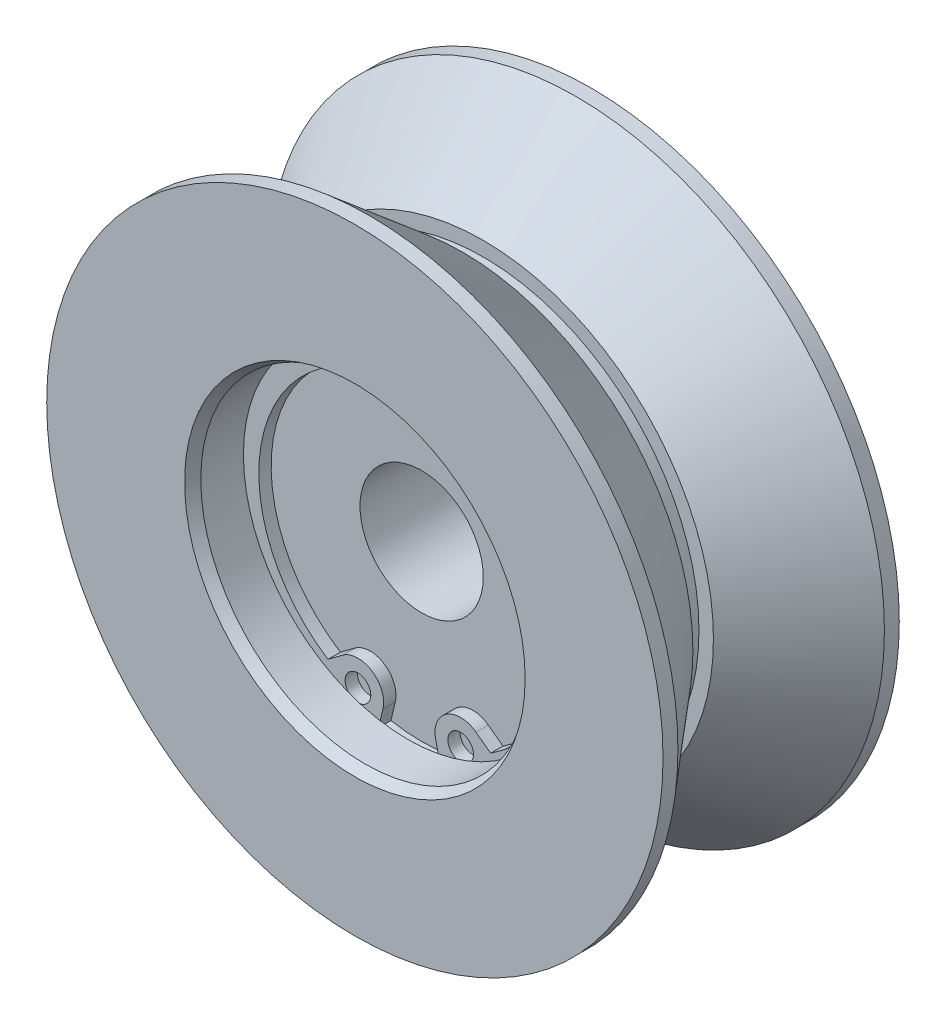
ISO-10303-21;
HEADER;
FILE_DESCRIPTION(('STEP AP214'),'2;1');
FILE_NAME('part.step','',(''),(''),'','','');
FILE_SCHEMA(('AUTOMOTIVE_DESIGN { 1 0 10303 214 1 1 1 1 }'));
ENDSEC;
DATA;
#1=APPLICATION_CONTEXT('core data for automotive mechanical design processes');
#2=APPLICATION_PROTOCOL_DEFINITION('international standard','automotive_design',2000,#1);
#3=PRODUCT_CONTEXT('',#1,'mechanical');
#4=PRODUCT('Part','Part','',(#3));
#5=PRODUCT_RELATED_PRODUCT_CATEGORY('part','',(#4));
#6=PRODUCT_DEFINITION_FORMATION('','',#4);
#7=PRODUCT_DEFINITION_CONTEXT('part definition',#1,'design');
#8=PRODUCT_DEFINITION('design','',#6,#7);
#9=PRODUCT_DEFINITION_SHAPE('','',#8);
#10=(LENGTH_UNIT() NAMED_UNIT(*) SI_UNIT(.MILLI.,.METRE.));
#11=(NAMED_UNIT(*) PLANE_ANGLE_UNIT() SI_UNIT($,.RADIAN.));
#12=(NAMED_UNIT(*) SI_UNIT($,.STERADIAN.) SOLID_ANGLE_UNIT());
#13=UNCERTAINTY_MEASURE_WITH_UNIT(LENGTH_MEASURE(1.E-05),#10,'distance_accuracy_value','');
#14=(GEOMETRIC_REPRESENTATION_CONTEXT(3) GLOBAL_UNCERTAINTY_ASSIGNED_CONTEXT((#13)) GLOBAL_UNIT_ASSIGNED_CONTEXT((#10,
#11,#12)) REPRESENTATION_CONTEXT('',''));
#15=CARTESIAN_POINT('',(0.,0.,0.));
#16=DIRECTION('',(0.,0.,1.));
#17=DIRECTION('',(1.,0.,0.));
#18=AXIS2_PLACEMENT_3D('',#15,#16,#17);
#19=CARTESIAN_POINT('',(0.,-0.95,6.2));
#20=DIRECTION('',(0.,0.,1.));
#21=DIRECTION('',(-1.,0.,0.));
#22=AXIS2_PLACEMENT_3D('',#19,#20,#21);
#23=CYLINDRICAL_SURFACE('',#22,14.65);
#24=CARTESIAN_POINT('',(0.,-0.95,5.));
#25=DIRECTION('',(0.,0.,-1.));
#26=DIRECTION('',(0.,-1.,0.));
#27=AXIS2_PLACEMENT_3D('',#24,#25,#26);
#28=CIRCLE('',#27,14.65);
#29=CARTESIAN_POINT('',(-7.91695293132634,-13.2765711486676,5.));
#30=VERTEX_POINT('',#29);
#31=CARTESIAN_POINT('',(7.91695293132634,-13.2765711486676,5.));
#32=VERTEX_POINT('',#31);
#33=EDGE_CURVE('E161',#30,#32,#28,.T.);
#34=ORIENTED_EDGE('',*,*,#33,.T.);
#35=DIRECTION('',(0.,0.,-1.));
#36=VECTOR('',#35,1.);
#37=CARTESIAN_POINT('',(7.91695293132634,-13.2765711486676,6.2));
#38=LINE('',#37,#36);
#39=CARTESIAN_POINT('',(7.91695293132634,-13.2765711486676,6.2));
#40=VERTEX_POINT('',#39);
#41=EDGE_CURVE('E101',#40,#32,#38,.T.);
#42=ORIENTED_EDGE('',*,*,#41,.F.);
#43=CARTESIAN_POINT('',(0.,-0.95,6.2));
#44=DIRECTION('',(0.,0.,-1.));
#45=DIRECTION('',(0.,-1.,0.));
#46=AXIS2_PLACEMENT_3D('',#43,#44,#45);
#47=CIRCLE('',#46,14.65);
#48=CARTESIAN_POINT('',(-7.91695293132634,-13.2765711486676,6.2));
#49=VERTEX_POINT('',#48);
#50=EDGE_CURVE('E102',#49,#40,#47,.T.);
#51=ORIENTED_EDGE('',*,*,#50,.F.);
#52=DIRECTION('',(0.,0.,-1.));
#53=VECTOR('',#52,1.);
#54=CARTESIAN_POINT('',(-7.91695293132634,-13.2765711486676,6.2));
#55=LINE('',#54,#53);
#56=EDGE_CURVE('E96',#49,#30,#55,.T.);
#57=ORIENTED_EDGE('',*,*,#56,.T.);
#58=EDGE_LOOP('',(#34,#42,#51,#57));
#59=FACE_BOUND('',#58,.T.);
#60=ADVANCED_FACE('F14',(#59),#23,.F.);
#61=CARTESIAN_POINT('',(6.49138441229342,-12.2169439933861,6.2));
#62=DIRECTION('',(-0.596553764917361,-0.802573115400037,0.));
#63=DIRECTION('',(-0.802573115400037,0.596553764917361,0.));
#64=AXIS2_PLACEMENT_3D('',#61,#62,#63);
#65=PLANE('',#64);
#66=DIRECTION('',(-0.802573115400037,0.596553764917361,0.));
#67=VECTOR('',#66,1.);
#68=CARTESIAN_POINT('',(6.49138441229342,-12.2169439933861,5.));
#69=LINE('',#68,#67);
#70=CARTESIAN_POINT('',(6.49138441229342,-12.2169439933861,5.));
#71=VERTEX_POINT('',#70);
#72=EDGE_CURVE('E145',#32,#71,#69,.T.);
#73=ORIENTED_EDGE('',*,*,#72,.T.);
#74=DIRECTION('',(0.,0.,-1.));
#75=VECTOR('',#74,1.);
#76=CARTESIAN_POINT('',(6.49138441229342,-12.2169439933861,6.2));
#77=LINE('',#76,#75);
#78=CARTESIAN_POINT('',(6.49138441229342,-12.2169439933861,6.2));
#79=VERTEX_POINT('',#78);
#80=EDGE_CURVE('E150',#79,#71,#77,.T.);
#81=ORIENTED_EDGE('',*,*,#80,.F.);
#82=DIRECTION('',(-0.802573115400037,0.596553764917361,0.));
#83=VECTOR('',#82,1.);
#84=CARTESIAN_POINT('',(6.49138441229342,-12.2169439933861,6.2));
#85=LINE('',#84,#83);
#86=EDGE_CURVE('E135',#40,#79,#85,.T.);
#87=ORIENTED_EDGE('',*,*,#86,.F.);
#88=ORIENTED_EDGE('',*,*,#41,.T.);
#89=EDGE_LOOP('',(#73,#81,#87,#88));
#90=FACE_BOUND('',#89,.T.);
#91=ADVANCED_FACE('F291',(#90),#65,.F.);
#92=CARTESIAN_POINT('',(5.,-14.2233767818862,6.2));
#93=DIRECTION('',(0.,0.,1.));
#94=DIRECTION('',(-1.,0.,0.));
#95=AXIS2_PLACEMENT_3D('',#92,#93,#94);
#96=CYLINDRICAL_SURFACE('',#95,2.5);
#97=CARTESIAN_POINT('',(5.,-14.2233767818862,5.));
#98=DIRECTION('',(0.,0.,1.));
#99=DIRECTION('',(1.,0.,0.));
#100=AXIS2_PLACEMENT_3D('',#97,#98,#99);
#101=CIRCLE('',#100,2.5);
#102=CARTESIAN_POINT('',(2.5678231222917,-14.8017500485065,5.));
#103=VERTEX_POINT('',#102);
#104=EDGE_CURVE('E131',#71,#103,#101,.T.);
#105=ORIENTED_EDGE('',*,*,#104,.T.);
#106=DIRECTION('',(0.,0.,-1.));
#107=VECTOR('',#106,1.);
#108=CARTESIAN_POINT('',(2.5678231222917,-14.8017500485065,6.2));
#109=LINE('',#108,#107);
#110=CARTESIAN_POINT('',(2.5678231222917,-14.8017500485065,6.2));
#111=VERTEX_POINT('',#110);
#112=EDGE_CURVE('E151',#111,#103,#109,.T.);
#113=ORIENTED_EDGE('',*,*,#112,.F.);
#114=CARTESIAN_POINT('',(5.,-14.2233767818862,6.2));
#115=DIRECTION('',(0.,0.,1.));
#116=DIRECTION('',(1.,0.,0.));
#117=AXIS2_PLACEMENT_3D('',#114,#115,#116);
#118=CIRCLE('',#117,2.5);
#119=EDGE_CURVE('E166',#79,#111,#118,.T.);
#120=ORIENTED_EDGE('',*,*,#119,.F.);
#121=ORIENTED_EDGE('',*,*,#80,.T.);
#122=EDGE_LOOP('',(#105,#113,#120,#121));
#123=FACE_BOUND('',#122,.T.);
#124=ADVANCED_FACE('F288',(#123),#96,.T.);
#125=CARTESIAN_POINT('',(-2.56782312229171,-14.8017500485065,6.2));
#126=DIRECTION('',(-0.97287075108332,0.231349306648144,0.));
#127=DIRECTION('',(0.,0.,1.));
#128=AXIS2_PLACEMENT_3D('',#125,#126,#127);
#129=PLANE('',#128);
#130=DIRECTION('',(0.,0.,1.));
#131=VECTOR('',#130,1.);
#132=CARTESIAN_POINT('',(-2.99125499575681,-16.5823669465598,20.1183293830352));
#133=LINE('',#132,#131);
#134=CARTESIAN_POINT('',(-2.99125499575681,-16.5823669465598,5.));
#135=VERTEX_POINT('',#134);
#136=CARTESIAN_POINT('',(-2.99125499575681,-16.5823669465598,6.2));
#137=VERTEX_POINT('',#136);
#138=EDGE_CURVE('E175',#135,#137,#133,.T.);
#139=ORIENTED_EDGE('',*,*,#138,.F.);
#140=DIRECTION('',(0.231349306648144,0.97287075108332,0.));
#141=VECTOR('',#140,1.);
#142=CARTESIAN_POINT('',(-2.56782312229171,-14.8017500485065,5.));
#143=LINE('',#142,#141);
#144=CARTESIAN_POINT('',(-2.56782312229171,-14.8017500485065,5.));
#145=VERTEX_POINT('',#144);
#146=EDGE_CURVE('E152',#135,#145,#143,.T.);
#147=ORIENTED_EDGE('',*,*,#146,.T.);
#148=DIRECTION('',(0.,0.,-1.));
#149=VECTOR('',#148,1.);
#150=CARTESIAN_POINT('',(-2.56782312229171,-14.8017500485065,6.2));
#151=LINE('',#150,#149);
#152=CARTESIAN_POINT('',(-2.56782312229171,-14.8017500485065,6.2));
#153=VERTEX_POINT('',#152);
#154=EDGE_CURVE('E171',#153,#145,#151,.T.);
#155=ORIENTED_EDGE('',*,*,#154,.F.);
#156=DIRECTION('',(0.231349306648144,0.97287075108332,0.));
#157=VECTOR('',#156,1.);
#158=CARTESIAN_POINT('',(-2.56782312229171,-14.8017500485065,6.2));
#159=LINE('',#158,#157);
#160=EDGE_CURVE('E119',#137,#153,#159,.T.);
#161=ORIENTED_EDGE('',*,*,#160,.F.);
#162=EDGE_LOOP('',(#139,#147,#155,#161));
#163=FACE_BOUND('',#162,.T.);
#164=ADVANCED_FACE('F301',(#163),#129,.F.);
#165=CARTESIAN_POINT('',(0.,-0.95,6.2));
#166=DIRECTION('',(0.,0.,-1.));
#167=DIRECTION('',(0.,-1.,0.));
#168=AXIS2_PLACEMENT_3D('',#165,#166,#167);
#169=PLANE('',#168);
#170=CARTESIAN_POINT('',(5.,-14.2233767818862,6.2));
#171=DIRECTION('',(0.,0.,1.));
#172=DIRECTION('',(1.,0.,0.));
#173=AXIS2_PLACEMENT_3D('',#170,#171,#172);
#174=CIRCLE('',#173,1.25);
#175=CARTESIAN_POINT('',(6.25,-14.2233767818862,6.2));
#176=VERTEX_POINT('',#175);
#177=EDGE_CURVE('E137',#176,#176,#174,.T.);
#178=ORIENTED_EDGE('',*,*,#177,.F.);
#179=EDGE_LOOP('',(#178));
#180=FACE_BOUND('',#179,.T.);
#181=CARTESIAN_POINT('',(-5.,-14.2233767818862,6.2));
#182=DIRECTION('',(0.,0.,-1.));
#183=DIRECTION('',(1.,0.,0.));
#184=AXIS2_PLACEMENT_3D('',#181,#182,#183);
#185=CIRCLE('',#184,1.25);
#186=CARTESIAN_POINT('',(-3.75,-14.2233767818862,6.2));
#187=VERTEX_POINT('',#186);
#188=EDGE_CURVE('E121',#187,#187,#185,.T.);
#189=ORIENTED_EDGE('',*,*,#188,.T.);
#190=EDGE_LOOP('',(#189));
#191=FACE_BOUND('',#190,.T.);
#192=CARTESIAN_POINT('',(0.,0.,6.2));
#193=DIRECTION('',(0.,0.,-1.));
#194=DIRECTION('',(-1.,0.,0.));
#195=AXIS2_PLACEMENT_3D('',#192,#193,#194);
#196=CIRCLE('',#195,16.85);
#197=CARTESIAN_POINT('',(2.99125499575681,-16.5823669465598,6.2));
#198=VERTEX_POINT('',#197);
#199=EDGE_CURVE('E9',#137,#198,#196,.T.);
#200=ORIENTED_EDGE('',*,*,#199,.F.);
#201=ORIENTED_EDGE('',*,*,#160,.T.);
#202=CARTESIAN_POINT('',(-5.,-14.2233767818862,6.2));
#203=DIRECTION('',(0.,0.,1.));
#204=DIRECTION('',(-1.,0.,0.));
#205=AXIS2_PLACEMENT_3D('',#202,#203,#204);
#206=CIRCLE('',#205,2.5);
#207=CARTESIAN_POINT('',(-6.49138441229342,-12.2169439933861,6.2));
#208=VERTEX_POINT('',#207);
#209=EDGE_CURVE('E108',#153,#208,#206,.T.);
#210=ORIENTED_EDGE('',*,*,#209,.T.);
#211=DIRECTION('',(-0.802573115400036,-0.596553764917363,0.));
#212=VECTOR('',#211,1.);
#213=CARTESIAN_POINT('',(-6.49138441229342,-12.2169439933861,6.2));
#214=LINE('',#213,#212);
#215=EDGE_CURVE('E91',#208,#49,#214,.T.);
#216=ORIENTED_EDGE('',*,*,#215,.T.);
#217=ORIENTED_EDGE('',*,*,#50,.T.);
#218=ORIENTED_EDGE('',*,*,#86,.T.);
#219=ORIENTED_EDGE('',*,*,#119,.T.);
#220=DIRECTION('',(0.231349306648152,-0.972870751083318,0.));
#221=VECTOR('',#220,1.);
#222=CARTESIAN_POINT('',(2.5678231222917,-14.8017500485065,6.2));
#223=LINE('',#222,#221);
#224=EDGE_CURVE('E127',#111,#198,#223,.T.);
#225=ORIENTED_EDGE('',*,*,#224,.T.);
#226=EDGE_LOOP('',(#200,#201,#210,#216,#217,#218,#219,#225));
#227=FACE_BOUND('',#226,.T.);
#228=ADVANCED_FACE('F117',(#180,#191,#227),#169,.F.);
#229=CARTESIAN_POINT('',(5.,-14.2233767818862,6.2));
#230=DIRECTION('',(0.,0.,1.));
#231=DIRECTION('',(-1.,0.,0.));
#232=AXIS2_PLACEMENT_3D('',#229,#230,#231);
#233=CYLINDRICAL_SURFACE('',#232,1.25);
#234=CARTESIAN_POINT('',(5.,-14.2233767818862,5.));
#235=DIRECTION('',(0.,0.,1.));
#236=DIRECTION('',(1.,0.,0.));
#237=AXIS2_PLACEMENT_3D('',#234,#235,#236);
#238=CIRCLE('',#237,1.25);
#239=CARTESIAN_POINT('',(6.25,-14.2233767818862,5.));
#240=VERTEX_POINT('',#239);
#241=EDGE_CURVE('E114',#240,#240,#238,.T.);
#242=ORIENTED_EDGE('',*,*,#241,.F.);
#243=EDGE_LOOP('',(#242));
#244=FACE_BOUND('',#243,.T.);
#245=ORIENTED_EDGE('',*,*,#177,.T.);
#246=EDGE_LOOP('',(#245));
#247=FACE_BOUND('',#246,.T.);
#248=ADVANCED_FACE('F309',(#244,#247),#233,.F.);
#249=CARTESIAN_POINT('',(-5.,-14.2233767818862,6.2));
#250=DIRECTION('',(0.,0.,1.));
#251=DIRECTION('',(-1.,0.,0.));
#252=AXIS2_PLACEMENT_3D('',#249,#250,#251);
#253=CYLINDRICAL_SURFACE('',#252,1.25);
#254=CARTESIAN_POINT('',(-5.,-14.2233767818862,5.));
#255=DIRECTION('',(0.,0.,-1.));
#256=DIRECTION('',(1.,0.,0.));
#257=AXIS2_PLACEMENT_3D('',#254,#255,#256);
#258=CIRCLE('',#257,1.25);
#259=CARTESIAN_POINT('',(-3.75,-14.2233767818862,5.));
#260=VERTEX_POINT('',#259);
#261=EDGE_CURVE('E140',#260,#260,#258,.T.);
#262=ORIENTED_EDGE('',*,*,#261,.T.);
#263=EDGE_LOOP('',(#262));
#264=FACE_BOUND('',#263,.T.);
#265=ORIENTED_EDGE('',*,*,#188,.F.);
#266=EDGE_LOOP('',(#265));
#267=FACE_BOUND('',#266,.T.);
#268=ADVANCED_FACE('F557',(#264,#267),#253,.F.);
#269=CARTESIAN_POINT('',(-6.49138441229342,-12.2169439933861,6.2));
#270=DIRECTION('',(0.596553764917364,-0.802573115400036,0.));
#271=DIRECTION('',(0.,0.,-1.));
#272=AXIS2_PLACEMENT_3D('',#269,#270,#271);
#273=PLANE('',#272);
#274=DIRECTION('',(-0.802573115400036,-0.596553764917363,0.));
#275=VECTOR('',#274,1.);
#276=CARTESIAN_POINT('',(-6.49138441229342,-12.2169439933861,5.));
#277=LINE('',#276,#275);
#278=CARTESIAN_POINT('',(-6.49138441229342,-12.2169439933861,5.));
#279=VERTEX_POINT('',#278);
#280=EDGE_CURVE('E113',#279,#30,#277,.T.);
#281=ORIENTED_EDGE('',*,*,#280,.T.);
#282=ORIENTED_EDGE('',*,*,#56,.F.);
#283=ORIENTED_EDGE('',*,*,#215,.F.);
#284=DIRECTION('',(0.,0.,-1.));
#285=VECTOR('',#284,1.);
#286=CARTESIAN_POINT('',(-6.49138441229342,-12.2169439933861,6.2));
#287=LINE('',#286,#285);
#288=EDGE_CURVE('E94',#208,#279,#287,.T.);
#289=ORIENTED_EDGE('',*,*,#288,.T.);
#290=EDGE_LOOP('',(#281,#282,#283,#289));
#291=FACE_BOUND('',#290,.T.);
#292=ADVANCED_FACE('F93',(#291),#273,.F.);
#293=CARTESIAN_POINT('',(-5.,-14.2233767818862,6.2));
#294=DIRECTION('',(0.,0.,1.));
#295=DIRECTION('',(-1.,0.,0.));
#296=AXIS2_PLACEMENT_3D('',#293,#294,#295);
#297=CYLINDRICAL_SURFACE('',#296,2.5);
#298=CARTESIAN_POINT('',(-5.,-14.2233767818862,5.));
#299=DIRECTION('',(0.,0.,1.));
#300=DIRECTION('',(-1.,0.,0.));
#301=AXIS2_PLACEMENT_3D('',#298,#299,#300);
#302=CIRCLE('',#301,2.5);
#303=EDGE_CURVE('E110',#145,#279,#302,.T.);
#304=ORIENTED_EDGE('',*,*,#303,.T.);
#305=ORIENTED_EDGE('',*,*,#288,.F.);
#306=ORIENTED_EDGE('',*,*,#209,.F.);
#307=ORIENTED_EDGE('',*,*,#154,.T.);
#308=EDGE_LOOP('',(#304,#305,#306,#307));
#309=FACE_BOUND('',#308,.T.);
#310=ADVANCED_FACE('F106',(#309),#297,.T.);
#311=CARTESIAN_POINT('',(2.5678231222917,-14.8017500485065,6.2));
#312=DIRECTION('',(0.972870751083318,0.231349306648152,0.));
#313=DIRECTION('',(0.,0.,-1.));
#314=AXIS2_PLACEMENT_3D('',#311,#312,#313);
#315=PLANE('',#314);
#316=DIRECTION('',(0.,0.,1.));
#317=VECTOR('',#316,1.);
#318=CARTESIAN_POINT('',(2.99125499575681,-16.5823669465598,20.1183293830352));
#319=LINE('',#318,#317);
#320=CARTESIAN_POINT('',(2.99125499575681,-16.5823669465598,5.));
#321=VERTEX_POINT('',#320);
#322=EDGE_CURVE('E18',#198,#321,#319,.F.);
#323=ORIENTED_EDGE('',*,*,#322,.F.);
#324=ORIENTED_EDGE('',*,*,#224,.F.);
#325=ORIENTED_EDGE('',*,*,#112,.T.);
#326=DIRECTION('',(0.231349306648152,-0.972870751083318,0.));
#327=VECTOR('',#326,1.);
#328=CARTESIAN_POINT('',(2.5678231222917,-14.8017500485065,5.));
#329=LINE('',#328,#327);
#330=EDGE_CURVE('E32',#103,#321,#329,.T.);
#331=ORIENTED_EDGE('',*,*,#330,.T.);
#332=EDGE_LOOP('',(#323,#324,#325,#331));
#333=FACE_BOUND('',#332,.T.);
#334=ADVANCED_FACE('F270',(#333),#315,.F.);
#335=CARTESIAN_POINT('',(0.,6.,5.));
#336=DIRECTION('',(0.,0.,-1.));
#337=DIRECTION('',(-1.,0.,0.));
#338=AXIS2_PLACEMENT_3D('',#335,#336,#337);
#339=PLANE('',#338);
#340=ORIENTED_EDGE('',*,*,#241,.T.);
#341=EDGE_LOOP('',(#340));
#342=FACE_BOUND('',#341,.T.);
#343=ADVANCED_FACE('F262',(#342),#339,.F.);
#344=ORIENTED_EDGE('',*,*,#261,.F.);
#345=EDGE_LOOP('',(#344));
#346=FACE_BOUND('',#345,.T.);
#347=ADVANCED_FACE('F261',(#346),#339,.F.);
#348=CARTESIAN_POINT('',(0.,0.,20.1183293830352));
#349=DIRECTION('',(0.,0.,1.));
#350=DIRECTION('',(1.,0.,0.));
#351=AXIS2_PLACEMENT_3D('',#348,#349,#350);
#352=CYLINDRICAL_SURFACE('',#351,21.);
#353=CARTESIAN_POINT('',(0.,0.,1.));
#354=DIRECTION('',(0.,0.,1.));
#355=DIRECTION('',(1.,0.,0.));
#356=AXIS2_PLACEMENT_3D('',#353,#354,#355);
#357=CIRCLE('',#356,21.);
#358=CARTESIAN_POINT('',(21.,0.,1.));
#359=VERTEX_POINT('',#358);
#360=EDGE_CURVE('E186',#359,#359,#357,.T.);
#361=ORIENTED_EDGE('',*,*,#360,.F.);
#362=EDGE_LOOP('',(#361));
#363=FACE_BOUND('',#362,.T.);
#364=CARTESIAN_POINT('',(0.,0.,-1.));
#365=DIRECTION('',(0.,0.,1.));
#366=DIRECTION('',(1.,0.,0.));
#367=AXIS2_PLACEMENT_3D('',#364,#365,#366);
#368=CIRCLE('',#367,21.);
#369=CARTESIAN_POINT('',(21.,0.,-1.));
#370=VERTEX_POINT('',#369);
#371=EDGE_CURVE('E183',#370,#370,#368,.T.);
#372=ORIENTED_EDGE('',*,*,#371,.T.);
#373=EDGE_LOOP('',(#372));
#374=FACE_BOUND('',#373,.T.);
#375=ADVANCED_FACE('F320',(#363,#374),#352,.T.);
#376=CARTESIAN_POINT('',(0.,21.,1.));
#377=DIRECTION('',(0.,0.,1.));
#378=DIRECTION('',(1.,0.,0.));
#379=AXIS2_PLACEMENT_3D('',#376,#377,#378);
#380=PLANE('',#379);
#381=CARTESIAN_POINT('',(0.,0.,1.));
#382=DIRECTION('',(0.,0.,1.));
#383=DIRECTION('',(1.,0.,0.));
#384=AXIS2_PLACEMENT_3D('',#381,#382,#383);
#385=CIRCLE('',#384,22.4061483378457);
#386=CARTESIAN_POINT('',(22.4061483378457,0.,1.));
#387=VERTEX_POINT('',#386);
#388=EDGE_CURVE('E189',#387,#387,#385,.T.);
#389=ORIENTED_EDGE('',*,*,#388,.F.);
#390=EDGE_LOOP('',(#389));
#391=FACE_BOUND('',#390,.T.);
#392=ORIENTED_EDGE('',*,*,#360,.T.);
#393=EDGE_LOOP('',(#392));
#394=FACE_BOUND('',#393,.T.);
#395=ADVANCED_FACE('F341',(#391,#394),#380,.F.);
#396=CARTESIAN_POINT('',(0.,21.,-1.));
#397=DIRECTION('',(0.,0.,-1.));
#398=DIRECTION('',(-1.,0.,0.));
#399=AXIS2_PLACEMENT_3D('',#396,#397,#398);
#400=PLANE('',#399);
#401=ORIENTED_EDGE('',*,*,#371,.F.);
#402=EDGE_LOOP('',(#401));
#403=FACE_BOUND('',#402,.T.);
#404=CARTESIAN_POINT('',(0.,0.,-1.));
#405=DIRECTION('',(0.,0.,1.));
#406=DIRECTION('',(1.,0.,0.));
#407=AXIS2_PLACEMENT_3D('',#404,#405,#406);
#408=CIRCLE('',#407,22.4061483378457);
#409=CARTESIAN_POINT('',(22.4061483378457,0.,-1.));
#410=VERTEX_POINT('',#409);
#411=EDGE_CURVE('E180',#410,#410,#408,.T.);
#412=ORIENTED_EDGE('',*,*,#411,.T.);
#413=EDGE_LOOP('',(#412));
#414=FACE_BOUND('',#413,.T.);
#415=ADVANCED_FACE('F338',(#403,#414),#400,.F.);
#416=CARTESIAN_POINT('',(0.,0.,1.));
#417=DIRECTION('',(0.,0.,1.));
#418=DIRECTION('',(1.,0.,0.));
#419=AXIS2_PLACEMENT_3D('',#416,#417,#418);
#420=CONICAL_SURFACE('',#419,22.4061483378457,0.69813170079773);
#421=CARTESIAN_POINT('',(0.,0.,10.05));
#422=DIRECTION('',(0.,0.,1.));
#423=DIRECTION('',(1.,0.,0.));
#424=AXIS2_PLACEMENT_3D('',#421,#422,#423);
#425=CIRCLE('',#424,30.);
#426=CARTESIAN_POINT('',(30.,0.,10.05));
#427=VERTEX_POINT('',#426);
#428=EDGE_CURVE('E192',#427,#427,#425,.T.);
#429=ORIENTED_EDGE('',*,*,#428,.F.);
#430=EDGE_LOOP('',(#429));
#431=FACE_BOUND('',#430,.T.);
#432=ORIENTED_EDGE('',*,*,#388,.T.);
#433=EDGE_LOOP('',(#432));
#434=FACE_BOUND('',#433,.T.);
#435=ADVANCED_FACE('F336',(#431,#434),#420,.T.);
#436=CARTESIAN_POINT('',(0.,0.,-10.05));
#437=DIRECTION('',(0.,0.,-1.));
#438=DIRECTION('',(-1.,0.,0.));
#439=AXIS2_PLACEMENT_3D('',#436,#437,#438);
#440=CONICAL_SURFACE('',#439,30.,0.69813170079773);
#441=ORIENTED_EDGE('',*,*,#411,.F.);
#442=EDGE_LOOP('',(#441));
#443=FACE_BOUND('',#442,.T.);
#444=CARTESIAN_POINT('',(0.,0.,-10.05));
#445=DIRECTION('',(0.,0.,1.));
#446=DIRECTION('',(1.,0.,0.));
#447=AXIS2_PLACEMENT_3D('',#444,#445,#446);
#448=CIRCLE('',#447,30.);
#449=CARTESIAN_POINT('',(30.,0.,-10.05));
#450=VERTEX_POINT('',#449);
#451=EDGE_CURVE('E177',#450,#450,#448,.T.);
#452=ORIENTED_EDGE('',*,*,#451,.T.);
#453=EDGE_LOOP('',(#452));
#454=FACE_BOUND('',#453,.T.);
#455=ADVANCED_FACE('F332',(#443,#454),#440,.T.);
#456=CARTESIAN_POINT('',(0.,0.,20.1183293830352));
#457=DIRECTION('',(0.,0.,1.));
#458=DIRECTION('',(1.,0.,0.));
#459=AXIS2_PLACEMENT_3D('',#456,#457,#458);
#460=CYLINDRICAL_SURFACE('',#459,30.);
#461=CARTESIAN_POINT('',(0.,0.,11.5));
#462=DIRECTION('',(0.,0.,1.));
#463=DIRECTION('',(1.,0.,0.));
#464=AXIS2_PLACEMENT_3D('',#461,#462,#463);
#465=CIRCLE('',#464,30.);
#466=CARTESIAN_POINT('',(30.,0.,11.5));
#467=VERTEX_POINT('',#466);
#468=EDGE_CURVE('E195',#467,#467,#465,.T.);
#469=ORIENTED_EDGE('',*,*,#468,.F.);
#470=EDGE_LOOP('',(#469));
#471=FACE_BOUND('',#470,.T.);
#472=ORIENTED_EDGE('',*,*,#428,.T.);
#473=EDGE_LOOP('',(#472));
#474=FACE_BOUND('',#473,.T.);
#475=ADVANCED_FACE('F335',(#471,#474),#460,.T.);
#476=CARTESIAN_POINT('',(0.,0.,20.1183293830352));
#477=DIRECTION('',(0.,0.,1.));
#478=DIRECTION('',(1.,0.,0.));
#479=AXIS2_PLACEMENT_3D('',#476,#477,#478);
#480=CYLINDRICAL_SURFACE('',#479,30.);
#481=ORIENTED_EDGE('',*,*,#451,.F.);
#482=EDGE_LOOP('',(#481));
#483=FACE_BOUND('',#482,.T.);
#484=CARTESIAN_POINT('',(0.,0.,-11.5));
#485=DIRECTION('',(0.,0.,1.));
#486=DIRECTION('',(1.,0.,0.));
#487=AXIS2_PLACEMENT_3D('',#484,#485,#486);
#488=CIRCLE('',#487,30.);
#489=CARTESIAN_POINT('',(30.,0.,-11.5));
#490=VERTEX_POINT('',#489);
#491=EDGE_CURVE('E141',#490,#490,#488,.T.);
#492=ORIENTED_EDGE('',*,*,#491,.T.);
#493=EDGE_LOOP('',(#492));
#494=FACE_BOUND('',#493,.T.);
#495=ADVANCED_FACE('F16',(#483,#494),#480,.T.);
#496=CARTESIAN_POINT('',(0.,30.,11.5));
#497=DIRECTION('',(0.,0.,-1.));
#498=DIRECTION('',(-1.,0.,0.));
#499=AXIS2_PLACEMENT_3D('',#496,#497,#498);
#500=PLANE('',#499);
#501=CARTESIAN_POINT('',(0.,0.,11.5));
#502=DIRECTION('',(0.,0.,1.));
#503=DIRECTION('',(1.,0.,0.));
#504=AXIS2_PLACEMENT_3D('',#501,#502,#503);
#505=CIRCLE('',#504,16.5773502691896);
#506=CARTESIAN_POINT('',(16.5773502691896,0.,11.5));
#507=VERTEX_POINT('',#506);
#508=EDGE_CURVE('E198',#507,#507,#505,.T.);
#509=ORIENTED_EDGE('',*,*,#508,.F.);
#510=EDGE_LOOP('',(#509));
#511=FACE_BOUND('',#510,.T.);
#512=ORIENTED_EDGE('',*,*,#468,.T.);
#513=EDGE_LOOP('',(#512));
#514=FACE_BOUND('',#513,.T.);
#515=ADVANCED_FACE('F233',(#511,#514),#500,.F.);
#516=CARTESIAN_POINT('',(0.,13.,-11.5));
#517=DIRECTION('',(0.,0.,1.));
#518=DIRECTION('',(1.,0.,0.));
#519=AXIS2_PLACEMENT_3D('',#516,#517,#518);
#520=PLANE('',#519);
#521=ORIENTED_EDGE('',*,*,#491,.F.);
#522=EDGE_LOOP('',(#521));
#523=FACE_BOUND('',#522,.T.);
#524=CARTESIAN_POINT('',(0.,0.,-11.5));
#525=DIRECTION('',(0.,0.,1.));
#526=DIRECTION('',(1.,0.,0.));
#527=AXIS2_PLACEMENT_3D('',#524,#525,#526);
#528=CIRCLE('',#527,13.);
#529=CARTESIAN_POINT('',(13.,0.,-11.5));
#530=VERTEX_POINT('',#529);
#531=EDGE_CURVE('E222',#530,#530,#528,.T.);
#532=ORIENTED_EDGE('',*,*,#531,.T.);
#533=EDGE_LOOP('',(#532));
#534=FACE_BOUND('',#533,.T.);
#535=ADVANCED_FACE('F229',(#523,#534),#520,.F.);
#536=CARTESIAN_POINT('',(0.,0.,11.5));
#537=DIRECTION('',(0.,0.,1.));
#538=DIRECTION('',(1.,0.,0.));
#539=AXIS2_PLACEMENT_3D('',#536,#537,#538);
#540=CONICAL_SURFACE('',#539,16.5773502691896,0.523598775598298);
#541=CARTESIAN_POINT('',(0.,0.,10.5));
#542=DIRECTION('',(0.,0.,1.));
#543=DIRECTION('',(1.,0.,0.));
#544=AXIS2_PLACEMENT_3D('',#541,#542,#543);
#545=CIRCLE('',#544,16.);
#546=CARTESIAN_POINT('',(16.,0.,10.5));
#547=VERTEX_POINT('',#546);
#548=EDGE_CURVE('E201',#547,#547,#545,.T.);
#549=ORIENTED_EDGE('',*,*,#548,.F.);
#550=EDGE_LOOP('',(#549));
#551=FACE_BOUND('',#550,.T.);
#552=ORIENTED_EDGE('',*,*,#508,.T.);
#553=EDGE_LOOP('',(#552));
#554=FACE_BOUND('',#553,.T.);
#555=ADVANCED_FACE('F232',(#551,#554),#540,.F.);
#556=CARTESIAN_POINT('',(0.,0.,20.1183293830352));
#557=DIRECTION('',(0.,0.,1.));
#558=DIRECTION('',(1.,0.,0.));
#559=AXIS2_PLACEMENT_3D('',#556,#557,#558);
#560=CYLINDRICAL_SURFACE('',#559,13.);
#561=ORIENTED_EDGE('',*,*,#531,.F.);
#562=EDGE_LOOP('',(#561));
#563=FACE_BOUND('',#562,.T.);
#564=CARTESIAN_POINT('',(0.,0.,-5.));
#565=DIRECTION('',(0.,0.,1.));
#566=DIRECTION('',(1.,0.,0.));
#567=AXIS2_PLACEMENT_3D('',#564,#565,#566);
#568=CIRCLE('',#567,13.);
#569=CARTESIAN_POINT('',(13.,0.,-5.));
#570=VERTEX_POINT('',#569);
#571=EDGE_CURVE('E219',#570,#570,#568,.T.);
#572=ORIENTED_EDGE('',*,*,#571,.T.);
#573=EDGE_LOOP('',(#572));
#574=FACE_BOUND('',#573,.T.);
#575=ADVANCED_FACE('F236',(#563,#574),#560,.F.);
#576=CARTESIAN_POINT('',(0.,0.,20.1183293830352));
#577=DIRECTION('',(0.,0.,1.));
#578=DIRECTION('',(1.,0.,0.));
#579=AXIS2_PLACEMENT_3D('',#576,#577,#578);
#580=CYLINDRICAL_SURFACE('',#579,16.);
#581=CARTESIAN_POINT('',(0.,0.,6.35));
#582=DIRECTION('',(0.,0.,1.));
#583=DIRECTION('',(1.,0.,0.));
#584=AXIS2_PLACEMENT_3D('',#581,#582,#583);
#585=CIRCLE('',#584,16.);
#586=CARTESIAN_POINT('',(16.,0.,6.35));
#587=VERTEX_POINT('',#586);
#588=EDGE_CURVE('E204',#587,#587,#585,.T.);
#589=ORIENTED_EDGE('',*,*,#588,.F.);
#590=EDGE_LOOP('',(#589));
#591=FACE_BOUND('',#590,.T.);
#592=ORIENTED_EDGE('',*,*,#548,.T.);
#593=EDGE_LOOP('',(#592));
#594=FACE_BOUND('',#593,.T.);
#595=ADVANCED_FACE('F239',(#591,#594),#580,.F.);
#596=CARTESIAN_POINT('',(0.,13.,-5.));
#597=DIRECTION('',(0.,0.,1.));
#598=DIRECTION('',(1.,0.,0.));
#599=AXIS2_PLACEMENT_3D('',#596,#597,#598);
#600=PLANE('',#599);
#601=ORIENTED_EDGE('',*,*,#571,.F.);
#602=EDGE_LOOP('',(#601));
#603=FACE_BOUND('',#602,.T.);
#604=CARTESIAN_POINT('',(0.,0.,-5.));
#605=DIRECTION('',(0.,0.,1.));
#606=DIRECTION('',(1.,0.,0.));
#607=AXIS2_PLACEMENT_3D('',#604,#605,#606);
#608=CIRCLE('',#607,6.);
#609=CARTESIAN_POINT('',(6.,0.,-5.));
#610=VERTEX_POINT('',#609);
#611=EDGE_CURVE('E216',#610,#610,#608,.T.);
#612=ORIENTED_EDGE('',*,*,#611,.T.);
#613=EDGE_LOOP('',(#612));
#614=FACE_BOUND('',#613,.T.);
#615=ADVANCED_FACE('F243',(#603,#614),#600,.F.);
#616=CARTESIAN_POINT('',(0.,16.85,6.35));
#617=DIRECTION('',(0.,0.,1.));
#618=DIRECTION('',(1.,0.,0.));
#619=AXIS2_PLACEMENT_3D('',#616,#617,#618);
#620=PLANE('',#619);
#621=CARTESIAN_POINT('',(0.,0.,6.35));
#622=DIRECTION('',(0.,0.,1.));
#623=DIRECTION('',(1.,0.,0.));
#624=AXIS2_PLACEMENT_3D('',#621,#622,#623);
#625=CIRCLE('',#624,16.85);
#626=CARTESIAN_POINT('',(16.85,0.,6.35));
#627=VERTEX_POINT('',#626);
#628=EDGE_CURVE('E207',#627,#627,#625,.T.);
#629=ORIENTED_EDGE('',*,*,#628,.F.);
#630=EDGE_LOOP('',(#629));
#631=FACE_BOUND('',#630,.T.);
#632=ORIENTED_EDGE('',*,*,#588,.T.);
#633=EDGE_LOOP('',(#632));
#634=FACE_BOUND('',#633,.T.);
#635=ADVANCED_FACE('F246',(#631,#634),#620,.F.);
#636=CARTESIAN_POINT('',(0.,0.,20.1183293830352));
#637=DIRECTION('',(0.,0.,1.));
#638=DIRECTION('',(1.,0.,0.));
#639=AXIS2_PLACEMENT_3D('',#636,#637,#638);
#640=CYLINDRICAL_SURFACE('',#639,16.85);
#641=ORIENTED_EDGE('',*,*,#628,.T.);
#642=EDGE_LOOP('',(#641));
#643=FACE_BOUND('',#642,.T.);
#644=ORIENTED_EDGE('',*,*,#199,.T.);
#645=ORIENTED_EDGE('',*,*,#322,.T.);
#646=CARTESIAN_POINT('',(0.,0.,5.));
#647=DIRECTION('',(0.,0.,1.));
#648=DIRECTION('',(1.,0.,0.));
#649=AXIS2_PLACEMENT_3D('',#646,#647,#648);
#650=CIRCLE('',#649,16.85);
#651=EDGE_CURVE('E210',#135,#321,#650,.T.);
#652=ORIENTED_EDGE('',*,*,#651,.F.);
#653=ORIENTED_EDGE('',*,*,#138,.T.);
#654=EDGE_LOOP('',(#644,#645,#652,#653));
#655=FACE_BOUND('',#654,.T.);
#656=ADVANCED_FACE('F254',(#643,#655),#640,.F.);
#657=CARTESIAN_POINT('',(0.,0.,20.1183293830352));
#658=DIRECTION('',(0.,0.,1.));
#659=DIRECTION('',(1.,0.,0.));
#660=AXIS2_PLACEMENT_3D('',#657,#658,#659);
#661=CYLINDRICAL_SURFACE('',#660,6.);
#662=ORIENTED_EDGE('',*,*,#611,.F.);
#663=EDGE_LOOP('',(#662));
#664=FACE_BOUND('',#663,.T.);
#665=CARTESIAN_POINT('',(0.,0.,5.));
#666=DIRECTION('',(0.,0.,1.));
#667=DIRECTION('',(1.,0.,0.));
#668=AXIS2_PLACEMENT_3D('',#665,#666,#667);
#669=CIRCLE('',#668,6.);
#670=CARTESIAN_POINT('',(6.,0.,5.));
#671=VERTEX_POINT('',#670);
#672=EDGE_CURVE('E213',#671,#671,#669,.T.);
#673=ORIENTED_EDGE('',*,*,#672,.T.);
#674=EDGE_LOOP('',(#673));
#675=FACE_BOUND('',#674,.T.);
#676=ADVANCED_FACE('F250',(#664,#675),#661,.F.);
#677=ORIENTED_EDGE('',*,*,#672,.F.);
#678=EDGE_LOOP('',(#677));
#679=FACE_BOUND('',#678,.T.);
#680=ORIENTED_EDGE('',*,*,#651,.T.);
#681=ORIENTED_EDGE('',*,*,#330,.F.);
#682=ORIENTED_EDGE('',*,*,#104,.F.);
#683=ORIENTED_EDGE('',*,*,#72,.F.);
#684=ORIENTED_EDGE('',*,*,#33,.F.);
#685=ORIENTED_EDGE('',*,*,#280,.F.);
#686=ORIENTED_EDGE('',*,*,#303,.F.);
#687=ORIENTED_EDGE('',*,*,#146,.F.);
#688=EDGE_LOOP('',(#680,#681,#682,#683,#684,#685,#686,#687));
#689=FACE_BOUND('',#688,.T.);
#690=ADVANCED_FACE('F253',(#679,#689),#339,.F.);
#691=CLOSED_SHELL('',(#60,#91,#124,#164,#228,#248,#268,#292,#310,#334,#343,#347,#375,#395,#415,
#435,#455,#475,#495,#515,#535,#555,#575,#595,#615,#635,#656,#676,#690));
#692=MANIFOLD_SOLID_BREP('B1',#691);
#693=ADVANCED_BREP_SHAPE_REPRESENTATION('',(#18,#692),#14);
#694=SHAPE_DEFINITION_REPRESENTATION(#9,#693);
ENDSEC;
END-ISO-10303-21;
